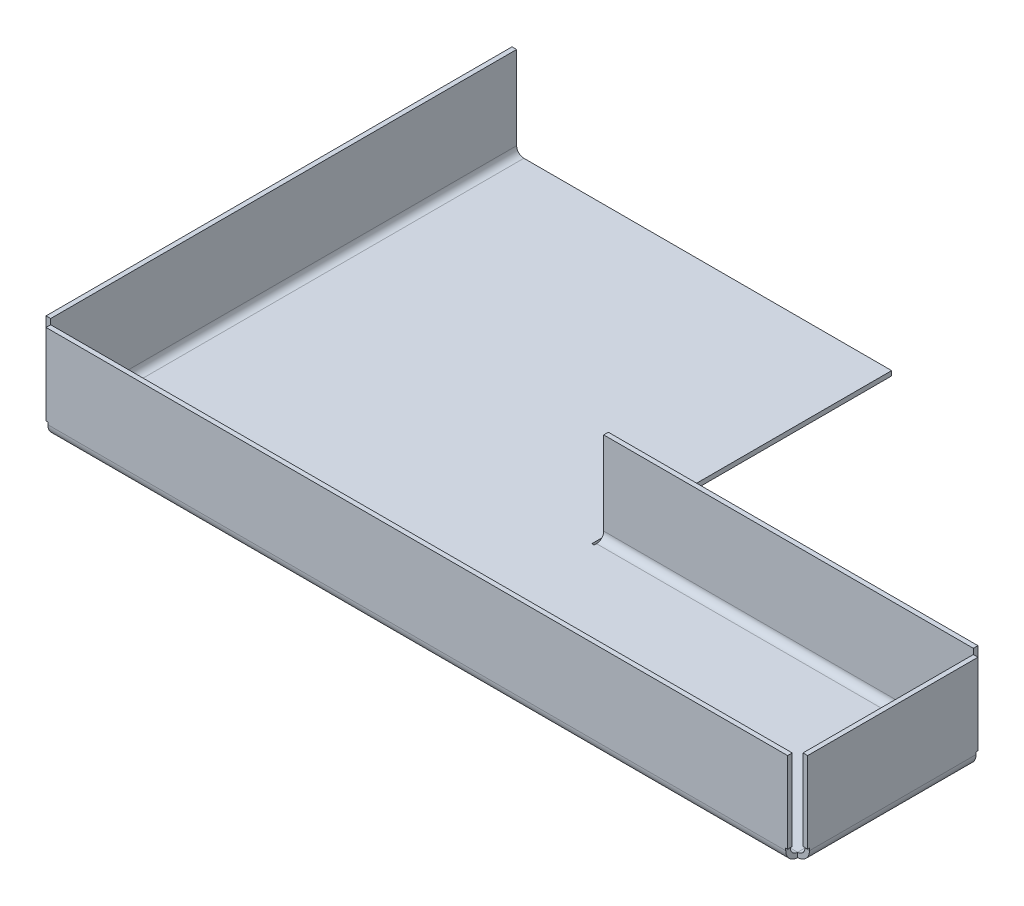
ISO-10303-21;
HEADER;
FILE_DESCRIPTION(('STEP AP214'),'2;1');
FILE_NAME('part.step','',(''),(''),'','','');
FILE_SCHEMA(('AUTOMOTIVE_DESIGN { 1 0 10303 214 1 1 1 1 }'));
ENDSEC;
DATA;
#1=APPLICATION_CONTEXT('core data for automotive mechanical design processes');
#2=APPLICATION_PROTOCOL_DEFINITION('international standard','automotive_design',2000,#1);
#3=PRODUCT_CONTEXT('',#1,'mechanical');
#4=PRODUCT('Part','Part','',(#3));
#5=PRODUCT_RELATED_PRODUCT_CATEGORY('part','',(#4));
#6=PRODUCT_DEFINITION_FORMATION('','',#4);
#7=PRODUCT_DEFINITION_CONTEXT('part definition',#1,'design');
#8=PRODUCT_DEFINITION('design','',#6,#7);
#9=PRODUCT_DEFINITION_SHAPE('','',#8);
#10=(LENGTH_UNIT() NAMED_UNIT(*) SI_UNIT(.MILLI.,.METRE.));
#11=(NAMED_UNIT(*) PLANE_ANGLE_UNIT() SI_UNIT($,.RADIAN.));
#12=(NAMED_UNIT(*) SI_UNIT($,.STERADIAN.) SOLID_ANGLE_UNIT());
#13=UNCERTAINTY_MEASURE_WITH_UNIT(LENGTH_MEASURE(1.E-05),#10,'distance_accuracy_value','');
#14=(GEOMETRIC_REPRESENTATION_CONTEXT(3) GLOBAL_UNCERTAINTY_ASSIGNED_CONTEXT((#13)) GLOBAL_UNIT_ASSIGNED_CONTEXT((#10,
#11,#12)) REPRESENTATION_CONTEXT('',''));
#15=CARTESIAN_POINT('',(0.,0.,0.));
#16=DIRECTION('',(0.,0.,1.));
#17=DIRECTION('',(1.,0.,0.));
#18=AXIS2_PLACEMENT_3D('',#15,#16,#17);
#19=CARTESIAN_POINT('',(0.,0.,-125.));
#20=DIRECTION('',(0.,0.,-1.));
#21=DIRECTION('',(1.,0.,0.));
#22=AXIS2_PLACEMENT_3D('',#19,#20,#21);
#23=PLANE('',#22);
#24=DIRECTION('',(1.,0.,0.));
#25=VECTOR('',#24,1.);
#26=CARTESIAN_POINT('',(0.,1.21412,-125.));
#27=LINE('',#26,#25);
#28=CARTESIAN_POINT('',(3.11912000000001,1.21412,-125.));
#29=VERTEX_POINT('',#28);
#30=CARTESIAN_POINT('',(99.69647,1.21412,-125.));
#31=VERTEX_POINT('',#30);
#32=EDGE_CURVE('E237',#29,#31,#27,.T.);
#33=ORIENTED_EDGE('',*,*,#32,.T.);
#34=DIRECTION('',(0.,1.,0.));
#35=VECTOR('',#34,1.);
#36=CARTESIAN_POINT('',(99.69647,0.,-125.));
#37=LINE('',#36,#35);
#38=CARTESIAN_POINT('',(99.69647,0.,-125.));
#39=VERTEX_POINT('',#38);
#40=EDGE_CURVE('E733',#31,#39,#37,.F.);
#41=ORIENTED_EDGE('',*,*,#40,.T.);
#42=DIRECTION('',(1.,0.,0.));
#43=VECTOR('',#42,1.);
#44=CARTESIAN_POINT('',(0.,0.,-125.));
#45=LINE('',#44,#43);
#46=CARTESIAN_POINT('',(3.11912000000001,0.,-125.));
#47=VERTEX_POINT('',#46);
#48=EDGE_CURVE('E423',#47,#39,#45,.T.);
#49=ORIENTED_EDGE('',*,*,#48,.F.);
#50=DIRECTION('',(0.,-1.,0.));
#51=VECTOR('',#50,1.);
#52=CARTESIAN_POINT('',(3.11912000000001,0.,-125.));
#53=LINE('',#52,#51);
#54=EDGE_CURVE('E11',#29,#47,#53,.T.);
#55=ORIENTED_EDGE('',*,*,#54,.F.);
#56=EDGE_LOOP('',(#33,#41,#49,#55));
#57=FACE_BOUND('',#56,.T.);
#58=ADVANCED_FACE('F38',(#57),#23,.T.);
#59=CARTESIAN_POINT('',(200.,25.,-50.));
#60=DIRECTION('',(0.,1.,0.));
#61=DIRECTION('',(1.,0.,0.));
#62=AXIS2_PLACEMENT_3D('',#59,#60,#61);
#63=PLANE('',#62);
#64=DIRECTION('',(1.,0.,0.));
#65=VECTOR('',#64,1.);
#66=CARTESIAN_POINT('',(200.,25.,-50.));
#67=LINE('',#66,#65);
#68=CARTESIAN_POINT('',(100.30353,25.,-50.));
#69=VERTEX_POINT('',#68);
#70=CARTESIAN_POINT('',(197.371666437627,25.,-50.));
#71=VERTEX_POINT('',#70);
#72=EDGE_CURVE('E732',#69,#71,#67,.T.);
#73=ORIENTED_EDGE('',*,*,#72,.F.);
#74=DIRECTION('',(0.,0.,-1.));
#75=VECTOR('',#74,1.);
#76=CARTESIAN_POINT('',(100.30353,25.,-48.78588));
#77=LINE('',#76,#75);
#78=CARTESIAN_POINT('',(100.30353,25.,-48.78588));
#79=VERTEX_POINT('',#78);
#80=EDGE_CURVE('E289',#69,#79,#77,.F.);
#81=ORIENTED_EDGE('',*,*,#80,.T.);
#82=DIRECTION('',(-1.,0.,0.));
#83=VECTOR('',#82,1.);
#84=CARTESIAN_POINT('',(200.,25.,-48.78588));
#85=LINE('',#84,#83);
#86=CARTESIAN_POINT('',(197.371666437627,25.,-48.78588));
#87=VERTEX_POINT('',#86);
#88=EDGE_CURVE('E218',#79,#87,#85,.F.);
#89=ORIENTED_EDGE('',*,*,#88,.T.);
#90=DIRECTION('',(0.,0.,-1.));
#91=VECTOR('',#90,1.);
#92=CARTESIAN_POINT('',(197.371666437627,25.,-50.));
#93=LINE('',#92,#91);
#94=EDGE_CURVE('E388',#87,#71,#93,.T.);
#95=ORIENTED_EDGE('',*,*,#94,.T.);
#96=EDGE_LOOP('',(#73,#81,#89,#95));
#97=FACE_BOUND('',#96,.T.);
#98=ADVANCED_FACE('F730',(#97),#63,.T.);
#99=CARTESIAN_POINT('',(0.,0.,0.));
#100=DIRECTION('',(0.,-1.,0.));
#101=DIRECTION('',(0.,0.,-1.));
#102=AXIS2_PLACEMENT_3D('',#99,#100,#101);
#103=PLANE('',#102);
#104=ORIENTED_EDGE('',*,*,#48,.T.);
#105=DIRECTION('',(0.,0.,-1.));
#106=VECTOR('',#105,1.);
#107=CARTESIAN_POINT('',(99.69647,0.,0.));
#108=LINE('',#107,#106);
#109=CARTESIAN_POINT('',(99.69647,0.,-46.27382));
#110=VERTEX_POINT('',#109);
#111=EDGE_CURVE('E406',#110,#39,#108,.T.);
#112=ORIENTED_EDGE('',*,*,#111,.F.);
#113=DIRECTION('',(-1.,0.,0.));
#114=VECTOR('',#113,1.);
#115=CARTESIAN_POINT('',(0.,0.,-46.2738200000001));
#116=LINE('',#115,#114);
#117=CARTESIAN_POINT('',(100.30353,0.,-46.27382));
#118=VERTEX_POINT('',#117);
#119=EDGE_CURVE('E419',#118,#110,#116,.T.);
#120=ORIENTED_EDGE('',*,*,#119,.F.);
#121=DIRECTION('',(0.,0.,1.));
#122=VECTOR('',#121,1.);
#123=CARTESIAN_POINT('',(100.30353,0.,0.));
#124=LINE('',#123,#122);
#125=CARTESIAN_POINT('',(100.30353,0.,-46.88088));
#126=VERTEX_POINT('',#125);
#127=EDGE_CURVE('E427',#126,#118,#124,.T.);
#128=ORIENTED_EDGE('',*,*,#127,.F.);
#129=DIRECTION('',(1.,0.,0.));
#130=VECTOR('',#129,1.);
#131=CARTESIAN_POINT('',(0.,0.,-46.88088));
#132=LINE('',#131,#130);
#133=CARTESIAN_POINT('',(196.88088,0.,-46.88088));
#134=VERTEX_POINT('',#133);
#135=EDGE_CURVE('E460',#126,#134,#132,.T.);
#136=ORIENTED_EDGE('',*,*,#135,.T.);
#137=DIRECTION('',(0.,0.,1.));
#138=VECTOR('',#137,1.);
#139=CARTESIAN_POINT('',(196.88088,0.,0.));
#140=LINE('',#139,#138);
#141=CARTESIAN_POINT('',(196.88088,0.,-3.11911999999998));
#142=VERTEX_POINT('',#141);
#143=EDGE_CURVE('E448',#134,#142,#140,.T.);
#144=ORIENTED_EDGE('',*,*,#143,.T.);
#145=DIRECTION('',(-1.,0.,0.));
#146=VECTOR('',#145,1.);
#147=CARTESIAN_POINT('',(0.,0.,-3.11912));
#148=LINE('',#147,#146);
#149=CARTESIAN_POINT('',(3.11911999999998,0.,-3.11911999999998));
#150=VERTEX_POINT('',#149);
#151=EDGE_CURVE('E437',#142,#150,#148,.T.);
#152=ORIENTED_EDGE('',*,*,#151,.T.);
#153=DIRECTION('',(0.,0.,-1.));
#154=VECTOR('',#153,1.);
#155=CARTESIAN_POINT('',(3.11912,0.,0.));
#156=LINE('',#155,#154);
#157=EDGE_CURVE('E429',#150,#47,#156,.T.);
#158=ORIENTED_EDGE('',*,*,#157,.T.);
#159=EDGE_LOOP('',(#104,#112,#120,#128,#136,#144,#152,#158));
#160=FACE_BOUND('',#159,.T.);
#161=ADVANCED_FACE('F417',(#160),#103,.T.);
#162=CARTESIAN_POINT('',(200.,25.,-50.));
#163=DIRECTION('',(0.,0.,-1.));
#164=DIRECTION('',(-1.,0.,0.));
#165=AXIS2_PLACEMENT_3D('',#162,#163,#164);
#166=PLANE('',#165);
#167=DIRECTION('',(0.,-1.,0.));
#168=VECTOR('',#167,1.);
#169=CARTESIAN_POINT('',(100.30353,25.,-50.));
#170=LINE('',#169,#168);
#171=CARTESIAN_POINT('',(100.30353,3.11912,-50.));
#172=VERTEX_POINT('',#171);
#173=EDGE_CURVE('E424',#69,#172,#170,.T.);
#174=ORIENTED_EDGE('',*,*,#173,.F.);
#175=ORIENTED_EDGE('',*,*,#72,.T.);
#176=DIRECTION('',(0.,-1.,0.));
#177=VECTOR('',#176,1.);
#178=CARTESIAN_POINT('',(197.371666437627,25.,-50.));
#179=LINE('',#178,#177);
#180=CARTESIAN_POINT('',(197.371666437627,3.716490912,-50.));
#181=VERTEX_POINT('',#180);
#182=EDGE_CURVE('E742',#71,#181,#179,.T.);
#183=ORIENTED_EDGE('',*,*,#182,.T.);
#184=DIRECTION('',(-1.,0.,0.));
#185=VECTOR('',#184,1.);
#186=CARTESIAN_POINT('',(200.,3.716490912,-50.));
#187=LINE('',#186,#185);
#188=CARTESIAN_POINT('',(196.88088,3.716490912,-50.));
#189=VERTEX_POINT('',#188);
#190=EDGE_CURVE('E560',#181,#189,#187,.T.);
#191=ORIENTED_EDGE('',*,*,#190,.T.);
#192=DIRECTION('',(0.,1.,0.));
#193=VECTOR('',#192,1.);
#194=CARTESIAN_POINT('',(196.88088,25.,-50.));
#195=LINE('',#194,#193);
#196=CARTESIAN_POINT('',(196.88088,3.11912,-50.));
#197=VERTEX_POINT('',#196);
#198=EDGE_CURVE('E561',#197,#189,#195,.T.);
#199=ORIENTED_EDGE('',*,*,#198,.F.);
#200=DIRECTION('',(1.,0.,0.));
#201=VECTOR('',#200,1.);
#202=CARTESIAN_POINT('',(200.,3.11912,-50.));
#203=LINE('',#202,#201);
#204=EDGE_CURVE('E187',#197,#172,#203,.F.);
#205=ORIENTED_EDGE('',*,*,#204,.T.);
#206=EDGE_LOOP('',(#174,#175,#183,#191,#199,#205));
#207=FACE_BOUND('',#206,.T.);
#208=ADVANCED_FACE('F576',(#207),#166,.T.);
#209=CARTESIAN_POINT('',(0.,1.21412,0.));
#210=DIRECTION('',(0.,-1.,0.));
#211=DIRECTION('',(0.,0.,-1.));
#212=AXIS2_PLACEMENT_3D('',#209,#210,#211);
#213=PLANE('',#212);
#214=DIRECTION('',(0.,0.,-1.));
#215=VECTOR('',#214,1.);
#216=CARTESIAN_POINT('',(99.69647,1.21412,0.));
#217=LINE('',#216,#215);
#218=CARTESIAN_POINT('',(99.69647,1.21412,-46.27382));
#219=VERTEX_POINT('',#218);
#220=EDGE_CURVE('E54',#219,#31,#217,.T.);
#221=ORIENTED_EDGE('',*,*,#220,.T.);
#222=ORIENTED_EDGE('',*,*,#32,.F.);
#223=DIRECTION('',(0.,0.,-1.));
#224=VECTOR('',#223,1.);
#225=CARTESIAN_POINT('',(3.11911999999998,1.21412,0.));
#226=LINE('',#225,#224);
#227=CARTESIAN_POINT('',(3.11911999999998,1.21412,-3.11911999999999));
#228=VERTEX_POINT('',#227);
#229=EDGE_CURVE('E204',#228,#29,#226,.T.);
#230=ORIENTED_EDGE('',*,*,#229,.F.);
#231=DIRECTION('',(1.,0.,0.));
#232=VECTOR('',#231,1.);
#233=CARTESIAN_POINT('',(0.,1.21412,-3.11911999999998));
#234=LINE('',#233,#232);
#235=CARTESIAN_POINT('',(196.88088,1.21412,-3.11911999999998));
#236=VERTEX_POINT('',#235);
#237=EDGE_CURVE('E203',#236,#228,#234,.F.);
#238=ORIENTED_EDGE('',*,*,#237,.F.);
#239=DIRECTION('',(0.,0.,-1.));
#240=VECTOR('',#239,1.);
#241=CARTESIAN_POINT('',(196.88088,1.21412,0.));
#242=LINE('',#241,#240);
#243=CARTESIAN_POINT('',(196.88088,1.21412,-46.88088));
#244=VERTEX_POINT('',#243);
#245=EDGE_CURVE('E481',#244,#236,#242,.F.);
#246=ORIENTED_EDGE('',*,*,#245,.F.);
#247=DIRECTION('',(1.,0.,0.));
#248=VECTOR('',#247,1.);
#249=CARTESIAN_POINT('',(0.,1.21412,-46.88088));
#250=LINE('',#249,#248);
#251=CARTESIAN_POINT('',(100.30353,1.21412,-46.88088));
#252=VERTEX_POINT('',#251);
#253=EDGE_CURVE('E477',#252,#244,#250,.T.);
#254=ORIENTED_EDGE('',*,*,#253,.F.);
#255=DIRECTION('',(0.,0.,-1.));
#256=VECTOR('',#255,1.);
#257=CARTESIAN_POINT('',(100.30353,1.21412,0.));
#258=LINE('',#257,#256);
#259=CARTESIAN_POINT('',(100.30353,1.21412,-46.27382));
#260=VERTEX_POINT('',#259);
#261=EDGE_CURVE('E303',#252,#260,#258,.F.);
#262=ORIENTED_EDGE('',*,*,#261,.T.);
#263=DIRECTION('',(1.,0.,0.));
#264=VECTOR('',#263,1.);
#265=CARTESIAN_POINT('',(0.,1.21412,-46.27382));
#266=LINE('',#265,#264);
#267=EDGE_CURVE('E306',#260,#219,#266,.F.);
#268=ORIENTED_EDGE('',*,*,#267,.T.);
#269=EDGE_LOOP('',(#221,#222,#230,#238,#246,#254,#262,#268));
#270=FACE_BOUND('',#269,.T.);
#271=ADVANCED_FACE('F516',(#270),#213,.F.);
#272=CARTESIAN_POINT('',(200.,25.,-48.78588));
#273=DIRECTION('',(0.,0.,-1.));
#274=DIRECTION('',(-1.,0.,0.));
#275=AXIS2_PLACEMENT_3D('',#272,#273,#274);
#276=PLANE('',#275);
#277=ORIENTED_EDGE('',*,*,#88,.F.);
#278=DIRECTION('',(0.,1.,0.));
#279=VECTOR('',#278,1.);
#280=CARTESIAN_POINT('',(100.30353,25.,-48.78588));
#281=LINE('',#280,#279);
#282=CARTESIAN_POINT('',(100.30353,3.11912,-48.78588));
#283=VERTEX_POINT('',#282);
#284=EDGE_CURVE('E293',#79,#283,#281,.F.);
#285=ORIENTED_EDGE('',*,*,#284,.T.);
#286=DIRECTION('',(-1.,0.,0.));
#287=VECTOR('',#286,1.);
#288=CARTESIAN_POINT('',(200.,3.11912000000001,-48.78588));
#289=LINE('',#288,#287);
#290=CARTESIAN_POINT('',(196.88088,3.11912000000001,-48.78588));
#291=VERTEX_POINT('',#290);
#292=EDGE_CURVE('E223',#291,#283,#289,.T.);
#293=ORIENTED_EDGE('',*,*,#292,.F.);
#294=DIRECTION('',(0.,1.,0.));
#295=VECTOR('',#294,1.);
#296=CARTESIAN_POINT('',(196.88088,25.,-48.78588));
#297=LINE('',#296,#295);
#298=CARTESIAN_POINT('',(196.88088,3.71649091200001,-48.78588));
#299=VERTEX_POINT('',#298);
#300=EDGE_CURVE('E290',#291,#299,#297,.T.);
#301=ORIENTED_EDGE('',*,*,#300,.T.);
#302=DIRECTION('',(-1.,0.,0.));
#303=VECTOR('',#302,1.);
#304=CARTESIAN_POINT('',(200.,3.71649091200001,-48.78588));
#305=LINE('',#304,#303);
#306=CARTESIAN_POINT('',(197.371666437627,3.71649091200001,-48.78588));
#307=VERTEX_POINT('',#306);
#308=EDGE_CURVE('E283',#307,#299,#305,.T.);
#309=ORIENTED_EDGE('',*,*,#308,.F.);
#310=DIRECTION('',(0.,1.,0.));
#311=VECTOR('',#310,1.);
#312=CARTESIAN_POINT('',(197.371666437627,25.,-48.78588));
#313=LINE('',#312,#311);
#314=EDGE_CURVE('E277',#87,#307,#313,.F.);
#315=ORIENTED_EDGE('',*,*,#314,.F.);
#316=EDGE_LOOP('',(#277,#285,#293,#301,#309,#315));
#317=FACE_BOUND('',#316,.T.);
#318=ADVANCED_FACE('F736',(#317),#276,.F.);
#319=CARTESIAN_POINT('',(99.69647,0.,0.));
#320=DIRECTION('',(-1.,0.,0.));
#321=DIRECTION('',(0.,0.,-1.));
#322=AXIS2_PLACEMENT_3D('',#319,#320,#321);
#323=PLANE('',#322);
#324=ORIENTED_EDGE('',*,*,#111,.T.);
#325=ORIENTED_EDGE('',*,*,#40,.F.);
#326=ORIENTED_EDGE('',*,*,#220,.F.);
#327=DIRECTION('',(0.,-1.,0.));
#328=VECTOR('',#327,1.);
#329=CARTESIAN_POINT('',(99.69647,0.,-46.27382));
#330=LINE('',#329,#328);
#331=EDGE_CURVE('E47',#219,#110,#330,.T.);
#332=ORIENTED_EDGE('',*,*,#331,.T.);
#333=EDGE_LOOP('',(#324,#325,#326,#332));
#334=FACE_BOUND('',#333,.T.);
#335=ADVANCED_FACE('F404',(#334),#323,.F.);
#336=CARTESIAN_POINT('',(0.,0.,-46.2738200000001));
#337=DIRECTION('',(0.,0.,1.));
#338=DIRECTION('',(-1.,0.,0.));
#339=AXIS2_PLACEMENT_3D('',#336,#337,#338);
#340=PLANE('',#339);
#341=ORIENTED_EDGE('',*,*,#331,.F.);
#342=ORIENTED_EDGE('',*,*,#267,.F.);
#343=DIRECTION('',(0.,-1.,0.));
#344=VECTOR('',#343,1.);
#345=CARTESIAN_POINT('',(100.30353,0.,-46.27382));
#346=LINE('',#345,#344);
#347=EDGE_CURVE('E396',#260,#118,#346,.T.);
#348=ORIENTED_EDGE('',*,*,#347,.T.);
#349=ORIENTED_EDGE('',*,*,#119,.T.);
#350=EDGE_LOOP('',(#341,#342,#348,#349));
#351=FACE_BOUND('',#350,.T.);
#352=ADVANCED_FACE('F426',(#351),#340,.F.);
#353=CARTESIAN_POINT('',(100.30353,0.,0.));
#354=DIRECTION('',(1.,0.,0.));
#355=DIRECTION('',(0.,0.,1.));
#356=AXIS2_PLACEMENT_3D('',#353,#354,#355);
#357=PLANE('',#356);
#358=ORIENTED_EDGE('',*,*,#347,.F.);
#359=ORIENTED_EDGE('',*,*,#261,.F.);
#360=DIRECTION('',(0.,-1.,0.));
#361=VECTOR('',#360,1.);
#362=CARTESIAN_POINT('',(100.30353,0.,-46.88088));
#363=LINE('',#362,#361);
#364=EDGE_CURVE('E393',#252,#126,#363,.T.);
#365=ORIENTED_EDGE('',*,*,#364,.T.);
#366=ORIENTED_EDGE('',*,*,#127,.T.);
#367=EDGE_LOOP('',(#358,#359,#365,#366));
#368=FACE_BOUND('',#367,.T.);
#369=ADVANCED_FACE('F585',(#368),#357,.F.);
#370=CARTESIAN_POINT('',(100.30353,3.11912,-46.88088));
#371=DIRECTION('',(1.,0.,0.));
#372=DIRECTION('',(0.,0.,-1.));
#373=AXIS2_PLACEMENT_3D('',#370,#371,#372);
#374=PLANE('',#373);
#375=ORIENTED_EDGE('',*,*,#364,.F.);
#376=CARTESIAN_POINT('',(100.30353,3.11912,-46.88088));
#377=DIRECTION('',(1.,0.,0.));
#378=DIRECTION('',(0.,0.,-1.));
#379=AXIS2_PLACEMENT_3D('',#376,#377,#378);
#380=CIRCLE('',#379,1.905);
#381=EDGE_CURVE('E267',#252,#283,#380,.T.);
#382=ORIENTED_EDGE('',*,*,#381,.T.);
#383=DIRECTION('',(0.,0.,-1.));
#384=VECTOR('',#383,1.);
#385=CARTESIAN_POINT('',(100.30353,3.11912,-50.));
#386=LINE('',#385,#384);
#387=EDGE_CURVE('E391',#283,#172,#386,.T.);
#388=ORIENTED_EDGE('',*,*,#387,.T.);
#389=CARTESIAN_POINT('',(100.30353,3.11912,-46.88088));
#390=DIRECTION('',(-1.,0.,0.));
#391=DIRECTION('',(0.,0.,1.));
#392=AXIS2_PLACEMENT_3D('',#389,#390,#391);
#393=CIRCLE('',#392,3.11912);
#394=EDGE_CURVE('E464',#126,#172,#393,.F.);
#395=ORIENTED_EDGE('',*,*,#394,.F.);
#396=EDGE_LOOP('',(#375,#382,#388,#395));
#397=FACE_BOUND('',#396,.T.);
#398=ADVANCED_FACE('F582',(#397),#374,.F.);
#399=CARTESIAN_POINT('',(100.30353,25.,-50.));
#400=DIRECTION('',(1.,0.,0.));
#401=DIRECTION('',(0.,-1.,0.));
#402=AXIS2_PLACEMENT_3D('',#399,#400,#401);
#403=PLANE('',#402);
#404=ORIENTED_EDGE('',*,*,#387,.F.);
#405=ORIENTED_EDGE('',*,*,#284,.F.);
#406=ORIENTED_EDGE('',*,*,#80,.F.);
#407=ORIENTED_EDGE('',*,*,#173,.T.);
#408=EDGE_LOOP('',(#404,#405,#406,#407));
#409=FACE_BOUND('',#408,.T.);
#410=ADVANCED_FACE('F568',(#409),#403,.F.);
#411=CARTESIAN_POINT('',(197.371666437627,25.,-50.));
#412=DIRECTION('',(1.,0.,0.));
#413=DIRECTION('',(0.,-1.,0.));
#414=AXIS2_PLACEMENT_3D('',#411,#412,#413);
#415=PLANE('',#414);
#416=ORIENTED_EDGE('',*,*,#94,.F.);
#417=ORIENTED_EDGE('',*,*,#314,.T.);
#418=DIRECTION('',(0.,0.,-1.));
#419=VECTOR('',#418,1.);
#420=CARTESIAN_POINT('',(197.371666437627,3.716490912,-50.));
#421=LINE('',#420,#419);
#422=EDGE_CURVE('E385',#307,#181,#421,.T.);
#423=ORIENTED_EDGE('',*,*,#422,.T.);
#424=ORIENTED_EDGE('',*,*,#182,.F.);
#425=EDGE_LOOP('',(#416,#417,#423,#424));
#426=FACE_BOUND('',#425,.T.);
#427=ADVANCED_FACE('F739',(#426),#415,.T.);
#428=CARTESIAN_POINT('',(200.,3.716490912,-50.));
#429=DIRECTION('',(0.,-1.,0.));
#430=DIRECTION('',(-1.,0.,0.));
#431=AXIS2_PLACEMENT_3D('',#428,#429,#430);
#432=PLANE('',#431);
#433=ORIENTED_EDGE('',*,*,#422,.F.);
#434=ORIENTED_EDGE('',*,*,#308,.T.);
#435=DIRECTION('',(0.,0.,-1.));
#436=VECTOR('',#435,1.);
#437=CARTESIAN_POINT('',(196.88088,3.716490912,-50.));
#438=LINE('',#437,#436);
#439=EDGE_CURVE('E382',#299,#189,#438,.T.);
#440=ORIENTED_EDGE('',*,*,#439,.T.);
#441=ORIENTED_EDGE('',*,*,#190,.F.);
#442=EDGE_LOOP('',(#433,#434,#440,#441));
#443=FACE_BOUND('',#442,.T.);
#444=ADVANCED_FACE('F775',(#443),#432,.T.);
#445=CARTESIAN_POINT('',(196.88088,25.,-50.));
#446=DIRECTION('',(-1.,0.,0.));
#447=DIRECTION('',(0.,1.,0.));
#448=AXIS2_PLACEMENT_3D('',#445,#446,#447);
#449=PLANE('',#448);
#450=ORIENTED_EDGE('',*,*,#439,.F.);
#451=ORIENTED_EDGE('',*,*,#300,.F.);
#452=DIRECTION('',(0.,0.,-1.));
#453=VECTOR('',#452,1.);
#454=CARTESIAN_POINT('',(196.88088,3.11912,-50.));
#455=LINE('',#454,#453);
#456=EDGE_CURVE('E63',#291,#197,#455,.T.);
#457=ORIENTED_EDGE('',*,*,#456,.T.);
#458=ORIENTED_EDGE('',*,*,#198,.T.);
#459=EDGE_LOOP('',(#450,#451,#457,#458));
#460=FACE_BOUND('',#459,.T.);
#461=ADVANCED_FACE('F778',(#460),#449,.F.);
#462=CARTESIAN_POINT('',(196.88088,3.11912,-46.88088));
#463=DIRECTION('',(-1.,0.,0.));
#464=DIRECTION('',(0.,0.,1.));
#465=AXIS2_PLACEMENT_3D('',#462,#463,#464);
#466=PLANE('',#465);
#467=ORIENTED_EDGE('',*,*,#456,.F.);
#468=CARTESIAN_POINT('',(196.88088,3.11912,-46.88088));
#469=DIRECTION('',(1.,0.,0.));
#470=DIRECTION('',(0.,0.,-1.));
#471=AXIS2_PLACEMENT_3D('',#468,#469,#470);
#472=CIRCLE('',#471,1.905);
#473=EDGE_CURVE('E286',#291,#244,#472,.F.);
#474=ORIENTED_EDGE('',*,*,#473,.T.);
#475=DIRECTION('',(0.,-1.,0.));
#476=VECTOR('',#475,1.);
#477=CARTESIAN_POINT('',(196.88088,0.,-46.88088));
#478=LINE('',#477,#476);
#479=EDGE_CURVE('E378',#244,#134,#478,.T.);
#480=ORIENTED_EDGE('',*,*,#479,.T.);
#481=CARTESIAN_POINT('',(196.88088,3.11912,-46.88088));
#482=DIRECTION('',(1.,0.,0.));
#483=DIRECTION('',(0.,0.,-1.));
#484=AXIS2_PLACEMENT_3D('',#481,#482,#483);
#485=CIRCLE('',#484,3.11912);
#486=EDGE_CURVE('E471',#197,#134,#485,.F.);
#487=ORIENTED_EDGE('',*,*,#486,.F.);
#488=EDGE_LOOP('',(#467,#474,#480,#487));
#489=FACE_BOUND('',#488,.T.);
#490=ADVANCED_FACE('F782',(#489),#466,.F.);
#491=CARTESIAN_POINT('',(196.88088,3.11912,-46.88088));
#492=DIRECTION('',(0.,0.,1.));
#493=DIRECTION('',(1.,0.,0.));
#494=AXIS2_PLACEMENT_3D('',#491,#492,#493);
#495=PLANE('',#494);
#496=ORIENTED_EDGE('',*,*,#479,.F.);
#497=CARTESIAN_POINT('',(196.88088,3.11912,-46.88088));
#498=DIRECTION('',(0.,0.,1.));
#499=DIRECTION('',(1.,0.,0.));
#500=AXIS2_PLACEMENT_3D('',#497,#498,#499);
#501=CIRCLE('',#500,1.905);
#502=CARTESIAN_POINT('',(198.78588,3.11912,-46.88088));
#503=VERTEX_POINT('',#502);
#504=EDGE_CURVE('E241',#244,#503,#501,.T.);
#505=ORIENTED_EDGE('',*,*,#504,.T.);
#506=DIRECTION('',(1.,0.,0.));
#507=VECTOR('',#506,1.);
#508=CARTESIAN_POINT('',(200.,3.11912,-46.88088));
#509=LINE('',#508,#507);
#510=CARTESIAN_POINT('',(200.,3.11912,-46.88088));
#511=VERTEX_POINT('',#510);
#512=EDGE_CURVE('E375',#503,#511,#509,.T.);
#513=ORIENTED_EDGE('',*,*,#512,.T.);
#514=CARTESIAN_POINT('',(196.88088,3.11912,-46.88088));
#515=DIRECTION('',(0.,0.,-1.));
#516=DIRECTION('',(-1.,0.,0.));
#517=AXIS2_PLACEMENT_3D('',#514,#515,#516);
#518=CIRCLE('',#517,3.11912);
#519=EDGE_CURVE('E452',#134,#511,#518,.F.);
#520=ORIENTED_EDGE('',*,*,#519,.F.);
#521=EDGE_LOOP('',(#496,#505,#513,#520));
#522=FACE_BOUND('',#521,.T.);
#523=ADVANCED_FACE('F502',(#522),#495,.F.);
#524=CARTESIAN_POINT('',(200.,25.,-46.88088));
#525=DIRECTION('',(0.,0.,1.));
#526=DIRECTION('',(0.,-1.,0.));
#527=AXIS2_PLACEMENT_3D('',#524,#525,#526);
#528=PLANE('',#527);
#529=ORIENTED_EDGE('',*,*,#512,.F.);
#530=DIRECTION('',(0.,1.,0.));
#531=VECTOR('',#530,1.);
#532=CARTESIAN_POINT('',(198.78588,25.,-46.88088));
#533=LINE('',#532,#531);
#534=CARTESIAN_POINT('',(198.78588,3.716490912,-46.88088));
#535=VERTEX_POINT('',#534);
#536=EDGE_CURVE('E280',#535,#503,#533,.F.);
#537=ORIENTED_EDGE('',*,*,#536,.F.);
#538=DIRECTION('',(1.,0.,0.));
#539=VECTOR('',#538,1.);
#540=CARTESIAN_POINT('',(200.,3.716490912,-46.88088));
#541=LINE('',#540,#539);
#542=CARTESIAN_POINT('',(200.,3.716490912,-46.88088));
#543=VERTEX_POINT('',#542);
#544=EDGE_CURVE('E372',#535,#543,#541,.T.);
#545=ORIENTED_EDGE('',*,*,#544,.T.);
#546=DIRECTION('',(0.,-1.,0.));
#547=VECTOR('',#546,1.);
#548=CARTESIAN_POINT('',(200.,25.,-46.88088));
#549=LINE('',#548,#547);
#550=EDGE_CURVE('E557',#543,#511,#549,.T.);
#551=ORIENTED_EDGE('',*,*,#550,.T.);
#552=EDGE_LOOP('',(#529,#537,#545,#551));
#553=FACE_BOUND('',#552,.T.);
#554=ADVANCED_FACE('F787',(#553),#528,.F.);
#555=CARTESIAN_POINT('',(200.,3.716490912,-50.));
#556=DIRECTION('',(0.,-1.,0.));
#557=DIRECTION('',(0.,0.,-1.));
#558=AXIS2_PLACEMENT_3D('',#555,#556,#557);
#559=PLANE('',#558);
#560=ORIENTED_EDGE('',*,*,#544,.F.);
#561=DIRECTION('',(0.,0.,-1.));
#562=VECTOR('',#561,1.);
#563=CARTESIAN_POINT('',(198.78588,3.716490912,-50.));
#564=LINE('',#563,#562);
#565=CARTESIAN_POINT('',(198.78588,3.716490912,-47.3716664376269));
#566=VERTEX_POINT('',#565);
#567=EDGE_CURVE('E261',#535,#566,#564,.T.);
#568=ORIENTED_EDGE('',*,*,#567,.T.);
#569=DIRECTION('',(1.,0.,0.));
#570=VECTOR('',#569,1.);
#571=CARTESIAN_POINT('',(200.,3.716490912,-47.3716664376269));
#572=LINE('',#571,#570);
#573=CARTESIAN_POINT('',(200.,3.716490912,-47.3716664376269));
#574=VERTEX_POINT('',#573);
#575=EDGE_CURVE('E369',#566,#574,#572,.T.);
#576=ORIENTED_EDGE('',*,*,#575,.T.);
#577=DIRECTION('',(0.,0.,-1.));
#578=VECTOR('',#577,1.);
#579=CARTESIAN_POINT('',(200.,3.716490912,-50.));
#580=LINE('',#579,#578);
#581=EDGE_CURVE('E554',#543,#574,#580,.T.);
#582=ORIENTED_EDGE('',*,*,#581,.F.);
#583=EDGE_LOOP('',(#560,#568,#576,#582));
#584=FACE_BOUND('',#583,.T.);
#585=ADVANCED_FACE('F790',(#584),#559,.T.);
#586=CARTESIAN_POINT('',(200.,25.,-47.3716664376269));
#587=DIRECTION('',(0.,0.,-1.));
#588=DIRECTION('',(0.,1.,0.));
#589=AXIS2_PLACEMENT_3D('',#586,#587,#588);
#590=PLANE('',#589);
#591=ORIENTED_EDGE('',*,*,#575,.F.);
#592=DIRECTION('',(0.,1.,0.));
#593=VECTOR('',#592,1.);
#594=CARTESIAN_POINT('',(198.78588,25.,-47.3716664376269));
#595=LINE('',#594,#593);
#596=CARTESIAN_POINT('',(198.78588,25.,-47.3716664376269));
#597=VERTEX_POINT('',#596);
#598=EDGE_CURVE('E273',#566,#597,#595,.T.);
#599=ORIENTED_EDGE('',*,*,#598,.T.);
#600=DIRECTION('',(1.,0.,0.));
#601=VECTOR('',#600,1.);
#602=CARTESIAN_POINT('',(200.,25.,-47.3716664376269));
#603=LINE('',#602,#601);
#604=CARTESIAN_POINT('',(200.,25.,-47.3716664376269));
#605=VERTEX_POINT('',#604);
#606=EDGE_CURVE('E366',#597,#605,#603,.T.);
#607=ORIENTED_EDGE('',*,*,#606,.T.);
#608=DIRECTION('',(0.,1.,0.));
#609=VECTOR('',#608,1.);
#610=CARTESIAN_POINT('',(200.,25.,-47.3716664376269));
#611=LINE('',#610,#609);
#612=EDGE_CURVE('E661',#574,#605,#611,.T.);
#613=ORIENTED_EDGE('',*,*,#612,.F.);
#614=EDGE_LOOP('',(#591,#599,#607,#613));
#615=FACE_BOUND('',#614,.T.);
#616=ADVANCED_FACE('F793',(#615),#590,.T.);
#617=CARTESIAN_POINT('',(200.,25.,-50.));
#618=DIRECTION('',(0.,1.,0.));
#619=DIRECTION('',(0.,0.,1.));
#620=AXIS2_PLACEMENT_3D('',#617,#618,#619);
#621=PLANE('',#620);
#622=ORIENTED_EDGE('',*,*,#606,.F.);
#623=DIRECTION('',(0.,0.,-1.));
#624=VECTOR('',#623,1.);
#625=CARTESIAN_POINT('',(198.78588,25.,-50.));
#626=LINE('',#625,#624);
#627=CARTESIAN_POINT('',(198.78588,25.,-2.6283335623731));
#628=VERTEX_POINT('',#627);
#629=EDGE_CURVE('E214',#597,#628,#626,.F.);
#630=ORIENTED_EDGE('',*,*,#629,.T.);
#631=DIRECTION('',(1.,0.,0.));
#632=VECTOR('',#631,1.);
#633=CARTESIAN_POINT('',(200.,25.,-2.6283335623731));
#634=LINE('',#633,#632);
#635=CARTESIAN_POINT('',(200.,25.,-2.6283335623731));
#636=VERTEX_POINT('',#635);
#637=EDGE_CURVE('E363',#628,#636,#634,.T.);
#638=ORIENTED_EDGE('',*,*,#637,.T.);
#639=DIRECTION('',(0.,0.,1.));
#640=VECTOR('',#639,1.);
#641=CARTESIAN_POINT('',(200.,25.,-50.));
#642=LINE('',#641,#640);
#643=EDGE_CURVE('E746',#605,#636,#642,.T.);
#644=ORIENTED_EDGE('',*,*,#643,.F.);
#645=EDGE_LOOP('',(#622,#630,#638,#644));
#646=FACE_BOUND('',#645,.T.);
#647=ADVANCED_FACE('F797',(#646),#621,.T.);
#648=CARTESIAN_POINT('',(200.,25.,-2.6283335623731));
#649=DIRECTION('',(0.,0.,1.));
#650=DIRECTION('',(0.,-1.,0.));
#651=AXIS2_PLACEMENT_3D('',#648,#649,#650);
#652=PLANE('',#651);
#653=ORIENTED_EDGE('',*,*,#637,.F.);
#654=DIRECTION('',(0.,1.,0.));
#655=VECTOR('',#654,1.);
#656=CARTESIAN_POINT('',(198.78588,25.,-2.6283335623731));
#657=LINE('',#656,#655);
#658=CARTESIAN_POINT('',(198.78588,3.716490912,-2.6283335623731));
#659=VERTEX_POINT('',#658);
#660=EDGE_CURVE('E253',#628,#659,#657,.F.);
#661=ORIENTED_EDGE('',*,*,#660,.T.);
#662=DIRECTION('',(1.,0.,0.));
#663=VECTOR('',#662,1.);
#664=CARTESIAN_POINT('',(200.,3.716490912,-2.6283335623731));
#665=LINE('',#664,#663);
#666=CARTESIAN_POINT('',(200.,3.716490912,-2.6283335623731));
#667=VERTEX_POINT('',#666);
#668=EDGE_CURVE('E360',#659,#667,#665,.T.);
#669=ORIENTED_EDGE('',*,*,#668,.T.);
#670=DIRECTION('',(0.,-1.,0.));
#671=VECTOR('',#670,1.);
#672=CARTESIAN_POINT('',(200.,25.,-2.6283335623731));
#673=LINE('',#672,#671);
#674=EDGE_CURVE('E657',#636,#667,#673,.T.);
#675=ORIENTED_EDGE('',*,*,#674,.F.);
#676=EDGE_LOOP('',(#653,#661,#669,#675));
#677=FACE_BOUND('',#676,.T.);
#678=ADVANCED_FACE('F801',(#677),#652,.T.);
#679=CARTESIAN_POINT('',(200.,3.716490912,-50.));
#680=DIRECTION('',(0.,-1.,0.));
#681=DIRECTION('',(0.,0.,-1.));
#682=AXIS2_PLACEMENT_3D('',#679,#680,#681);
#683=PLANE('',#682);
#684=ORIENTED_EDGE('',*,*,#668,.F.);
#685=DIRECTION('',(0.,0.,-1.));
#686=VECTOR('',#685,1.);
#687=CARTESIAN_POINT('',(198.78588,3.716490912,-50.));
#688=LINE('',#687,#686);
#689=CARTESIAN_POINT('',(198.78588,3.716490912,-3.11911999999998));
#690=VERTEX_POINT('',#689);
#691=EDGE_CURVE('E235',#659,#690,#688,.T.);
#692=ORIENTED_EDGE('',*,*,#691,.T.);
#693=DIRECTION('',(1.,0.,0.));
#694=VECTOR('',#693,1.);
#695=CARTESIAN_POINT('',(200.,3.716490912,-3.11911999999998));
#696=LINE('',#695,#694);
#697=CARTESIAN_POINT('',(200.,3.716490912,-3.11911999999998));
#698=VERTEX_POINT('',#697);
#699=EDGE_CURVE('E357',#690,#698,#696,.T.);
#700=ORIENTED_EDGE('',*,*,#699,.T.);
#701=DIRECTION('',(0.,0.,-1.));
#702=VECTOR('',#701,1.);
#703=CARTESIAN_POINT('',(200.,3.716490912,-50.));
#704=LINE('',#703,#702);
#705=EDGE_CURVE('E542',#667,#698,#704,.T.);
#706=ORIENTED_EDGE('',*,*,#705,.F.);
#707=EDGE_LOOP('',(#684,#692,#700,#706));
#708=FACE_BOUND('',#707,.T.);
#709=ADVANCED_FACE('F805',(#708),#683,.T.);
#710=CARTESIAN_POINT('',(200.,25.,-3.11911999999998));
#711=DIRECTION('',(0.,0.,-1.));
#712=DIRECTION('',(0.,1.,0.));
#713=AXIS2_PLACEMENT_3D('',#710,#711,#712);
#714=PLANE('',#713);
#715=ORIENTED_EDGE('',*,*,#699,.F.);
#716=DIRECTION('',(0.,1.,0.));
#717=VECTOR('',#716,1.);
#718=CARTESIAN_POINT('',(198.78588,25.,-3.11911999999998));
#719=LINE('',#718,#717);
#720=CARTESIAN_POINT('',(198.78588,3.11912,-3.11911999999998));
#721=VERTEX_POINT('',#720);
#722=EDGE_CURVE('E258',#721,#690,#719,.T.);
#723=ORIENTED_EDGE('',*,*,#722,.F.);
#724=DIRECTION('',(1.,0.,0.));
#725=VECTOR('',#724,1.);
#726=CARTESIAN_POINT('',(200.,3.11912,-3.11911999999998));
#727=LINE('',#726,#725);
#728=CARTESIAN_POINT('',(200.,3.11912,-3.11911999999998));
#729=VERTEX_POINT('',#728);
#730=EDGE_CURVE('E354',#721,#729,#727,.T.);
#731=ORIENTED_EDGE('',*,*,#730,.T.);
#732=DIRECTION('',(0.,1.,0.));
#733=VECTOR('',#732,1.);
#734=CARTESIAN_POINT('',(200.,25.,-3.11911999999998));
#735=LINE('',#734,#733);
#736=EDGE_CURVE('E534',#729,#698,#735,.T.);
#737=ORIENTED_EDGE('',*,*,#736,.T.);
#738=EDGE_LOOP('',(#715,#723,#731,#737));
#739=FACE_BOUND('',#738,.T.);
#740=ADVANCED_FACE('F532',(#739),#714,.F.);
#741=CARTESIAN_POINT('',(196.88088,3.11912,-3.11911999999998));
#742=DIRECTION('',(0.,0.,-1.));
#743=DIRECTION('',(-1.,0.,0.));
#744=AXIS2_PLACEMENT_3D('',#741,#742,#743);
#745=PLANE('',#744);
#746=ORIENTED_EDGE('',*,*,#730,.F.);
#747=CARTESIAN_POINT('',(196.88088,3.11912,-3.11911999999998));
#748=DIRECTION('',(0.,0.,1.));
#749=DIRECTION('',(1.,0.,0.));
#750=AXIS2_PLACEMENT_3D('',#747,#748,#749);
#751=CIRCLE('',#750,1.905);
#752=EDGE_CURVE('E264',#721,#236,#751,.F.);
#753=ORIENTED_EDGE('',*,*,#752,.T.);
#754=DIRECTION('',(0.,-1.,0.));
#755=VECTOR('',#754,1.);
#756=CARTESIAN_POINT('',(196.88088,0.,-3.11911999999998));
#757=LINE('',#756,#755);
#758=EDGE_CURVE('E351',#236,#142,#757,.T.);
#759=ORIENTED_EDGE('',*,*,#758,.T.);
#760=CARTESIAN_POINT('',(196.88088,3.11912,-3.11911999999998));
#761=DIRECTION('',(0.,0.,1.));
#762=DIRECTION('',(1.,0.,0.));
#763=AXIS2_PLACEMENT_3D('',#760,#761,#762);
#764=CIRCLE('',#763,3.11912);
#765=EDGE_CURVE('E461',#729,#142,#764,.F.);
#766=ORIENTED_EDGE('',*,*,#765,.F.);
#767=EDGE_LOOP('',(#746,#753,#759,#766));
#768=FACE_BOUND('',#767,.T.);
#769=ADVANCED_FACE('F524',(#768),#745,.F.);
#770=CARTESIAN_POINT('',(196.88088,3.11912,-3.11912));
#771=DIRECTION('',(-1.,0.,0.));
#772=DIRECTION('',(0.,0.,1.));
#773=AXIS2_PLACEMENT_3D('',#770,#771,#772);
#774=PLANE('',#773);
#775=ORIENTED_EDGE('',*,*,#758,.F.);
#776=CARTESIAN_POINT('',(196.88088,3.11912,-3.11912));
#777=DIRECTION('',(-1.,0.,0.));
#778=DIRECTION('',(0.,0.,1.));
#779=AXIS2_PLACEMENT_3D('',#776,#777,#778);
#780=CIRCLE('',#779,1.905);
#781=CARTESIAN_POINT('',(196.88088,3.11912,-1.21412));
#782=VERTEX_POINT('',#781);
#783=EDGE_CURVE('E210',#236,#782,#780,.T.);
#784=ORIENTED_EDGE('',*,*,#783,.T.);
#785=DIRECTION('',(0.,0.,1.));
#786=VECTOR('',#785,1.);
#787=CARTESIAN_POINT('',(196.88088,3.11912,0.));
#788=LINE('',#787,#786);
#789=CARTESIAN_POINT('',(196.88088,3.11912,0.));
#790=VERTEX_POINT('',#789);
#791=EDGE_CURVE('E348',#782,#790,#788,.T.);
#792=ORIENTED_EDGE('',*,*,#791,.T.);
#793=CARTESIAN_POINT('',(196.88088,3.11912,-3.11912));
#794=DIRECTION('',(1.,0.,0.));
#795=DIRECTION('',(0.,0.,-1.));
#796=AXIS2_PLACEMENT_3D('',#793,#794,#795);
#797=CIRCLE('',#796,3.11912);
#798=EDGE_CURVE('E440',#142,#790,#797,.F.);
#799=ORIENTED_EDGE('',*,*,#798,.F.);
#800=EDGE_LOOP('',(#775,#784,#792,#799));
#801=FACE_BOUND('',#800,.T.);
#802=ADVANCED_FACE('F814',(#801),#774,.F.);
#803=CARTESIAN_POINT('',(196.88088,25.,0.));
#804=DIRECTION('',(-1.,0.,0.));
#805=DIRECTION('',(0.,-1.,0.));
#806=AXIS2_PLACEMENT_3D('',#803,#804,#805);
#807=PLANE('',#806);
#808=ORIENTED_EDGE('',*,*,#791,.F.);
#809=DIRECTION('',(0.,1.,0.));
#810=VECTOR('',#809,1.);
#811=CARTESIAN_POINT('',(196.88088,25.,-1.21412));
#812=LINE('',#811,#810);
#813=CARTESIAN_POINT('',(196.88088,3.716490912,-1.21412));
#814=VERTEX_POINT('',#813);
#815=EDGE_CURVE('E257',#814,#782,#812,.F.);
#816=ORIENTED_EDGE('',*,*,#815,.F.);
#817=DIRECTION('',(0.,0.,1.));
#818=VECTOR('',#817,1.);
#819=CARTESIAN_POINT('',(196.88088,3.716490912,0.));
#820=LINE('',#819,#818);
#821=CARTESIAN_POINT('',(196.88088,3.716490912,0.));
#822=VERTEX_POINT('',#821);
#823=EDGE_CURVE('E345',#814,#822,#820,.T.);
#824=ORIENTED_EDGE('',*,*,#823,.T.);
#825=DIRECTION('',(0.,-1.,0.));
#826=VECTOR('',#825,1.);
#827=CARTESIAN_POINT('',(196.88088,25.,0.));
#828=LINE('',#827,#826);
#829=EDGE_CURVE('E546',#822,#790,#828,.T.);
#830=ORIENTED_EDGE('',*,*,#829,.T.);
#831=EDGE_LOOP('',(#808,#816,#824,#830));
#832=FACE_BOUND('',#831,.T.);
#833=ADVANCED_FACE('F625',(#832),#807,.F.);
#834=CARTESIAN_POINT('',(0.,3.716490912,0.));
#835=DIRECTION('',(0.,-1.,0.));
#836=DIRECTION('',(1.,0.,0.));
#837=AXIS2_PLACEMENT_3D('',#834,#835,#836);
#838=PLANE('',#837);
#839=ORIENTED_EDGE('',*,*,#823,.F.);
#840=DIRECTION('',(1.,0.,0.));
#841=VECTOR('',#840,1.);
#842=CARTESIAN_POINT('',(0.,3.716490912,-1.21412));
#843=LINE('',#842,#841);
#844=CARTESIAN_POINT('',(197.371666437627,3.716490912,-1.21412));
#845=VERTEX_POINT('',#844);
#846=EDGE_CURVE('E254',#814,#845,#843,.T.);
#847=ORIENTED_EDGE('',*,*,#846,.T.);
#848=DIRECTION('',(0.,0.,1.));
#849=VECTOR('',#848,1.);
#850=CARTESIAN_POINT('',(197.371666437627,3.716490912,0.));
#851=LINE('',#850,#849);
#852=CARTESIAN_POINT('',(197.371666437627,3.716490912,0.));
#853=VERTEX_POINT('',#852);
#854=EDGE_CURVE('E342',#845,#853,#851,.T.);
#855=ORIENTED_EDGE('',*,*,#854,.T.);
#856=DIRECTION('',(1.,0.,0.));
#857=VECTOR('',#856,1.);
#858=CARTESIAN_POINT('',(0.,3.716490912,0.));
#859=LINE('',#858,#857);
#860=EDGE_CURVE('E543',#822,#853,#859,.T.);
#861=ORIENTED_EDGE('',*,*,#860,.F.);
#862=EDGE_LOOP('',(#839,#847,#855,#861));
#863=FACE_BOUND('',#862,.T.);
#864=ADVANCED_FACE('F635',(#863),#838,.T.);
#865=CARTESIAN_POINT('',(197.371666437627,25.,0.));
#866=DIRECTION('',(1.,0.,0.));
#867=DIRECTION('',(0.,1.,0.));
#868=AXIS2_PLACEMENT_3D('',#865,#866,#867);
#869=PLANE('',#868);
#870=ORIENTED_EDGE('',*,*,#854,.F.);
#871=DIRECTION('',(0.,1.,0.));
#872=VECTOR('',#871,1.);
#873=CARTESIAN_POINT('',(197.371666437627,25.,-1.21412));
#874=LINE('',#873,#872);
#875=CARTESIAN_POINT('',(197.371666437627,25.,-1.21412));
#876=VERTEX_POINT('',#875);
#877=EDGE_CURVE('E248',#845,#876,#874,.T.);
#878=ORIENTED_EDGE('',*,*,#877,.T.);
#879=DIRECTION('',(0.,0.,1.));
#880=VECTOR('',#879,1.);
#881=CARTESIAN_POINT('',(197.371666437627,25.,0.));
#882=LINE('',#881,#880);
#883=CARTESIAN_POINT('',(197.371666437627,25.,0.));
#884=VERTEX_POINT('',#883);
#885=EDGE_CURVE('E339',#876,#884,#882,.T.);
#886=ORIENTED_EDGE('',*,*,#885,.T.);
#887=DIRECTION('',(0.,1.,0.));
#888=VECTOR('',#887,1.);
#889=CARTESIAN_POINT('',(197.371666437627,25.,0.));
#890=LINE('',#889,#888);
#891=EDGE_CURVE('E641',#853,#884,#890,.T.);
#892=ORIENTED_EDGE('',*,*,#891,.F.);
#893=EDGE_LOOP('',(#870,#878,#886,#892));
#894=FACE_BOUND('',#893,.T.);
#895=ADVANCED_FACE('F640',(#894),#869,.T.);
#896=CARTESIAN_POINT('',(0.,25.,0.));
#897=DIRECTION('',(0.,1.,0.));
#898=DIRECTION('',(-1.,0.,0.));
#899=AXIS2_PLACEMENT_3D('',#896,#897,#898);
#900=PLANE('',#899);
#901=ORIENTED_EDGE('',*,*,#885,.F.);
#902=DIRECTION('',(1.,0.,0.));
#903=VECTOR('',#902,1.);
#904=CARTESIAN_POINT('',(0.,25.,-1.21412));
#905=LINE('',#904,#903);
#906=CARTESIAN_POINT('',(2.6283335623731,25.,-1.21412));
#907=VERTEX_POINT('',#906);
#908=EDGE_CURVE('E220',#876,#907,#905,.F.);
#909=ORIENTED_EDGE('',*,*,#908,.T.);
#910=DIRECTION('',(0.,0.,1.));
#911=VECTOR('',#910,1.);
#912=CARTESIAN_POINT('',(2.6283335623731,25.,0.));
#913=LINE('',#912,#911);
#914=CARTESIAN_POINT('',(2.6283335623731,25.,0.));
#915=VERTEX_POINT('',#914);
#916=EDGE_CURVE('E336',#907,#915,#913,.T.);
#917=ORIENTED_EDGE('',*,*,#916,.T.);
#918=DIRECTION('',(-1.,0.,0.));
#919=VECTOR('',#918,1.);
#920=CARTESIAN_POINT('',(0.,25.,0.));
#921=LINE('',#920,#919);
#922=EDGE_CURVE('E652',#884,#915,#921,.T.);
#923=ORIENTED_EDGE('',*,*,#922,.F.);
#924=EDGE_LOOP('',(#901,#909,#917,#923));
#925=FACE_BOUND('',#924,.T.);
#926=ADVANCED_FACE('F647',(#925),#900,.T.);
#927=CARTESIAN_POINT('',(2.6283335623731,25.,0.));
#928=DIRECTION('',(-1.,0.,0.));
#929=DIRECTION('',(0.,-1.,0.));
#930=AXIS2_PLACEMENT_3D('',#927,#928,#929);
#931=PLANE('',#930);
#932=ORIENTED_EDGE('',*,*,#916,.F.);
#933=DIRECTION('',(0.,1.,0.));
#934=VECTOR('',#933,1.);
#935=CARTESIAN_POINT('',(2.6283335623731,25.,-1.21412));
#936=LINE('',#935,#934);
#937=CARTESIAN_POINT('',(2.6283335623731,3.716490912,-1.21412));
#938=VERTEX_POINT('',#937);
#939=EDGE_CURVE('E230',#907,#938,#936,.F.);
#940=ORIENTED_EDGE('',*,*,#939,.T.);
#941=DIRECTION('',(0.,0.,1.));
#942=VECTOR('',#941,1.);
#943=CARTESIAN_POINT('',(2.6283335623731,3.716490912,0.));
#944=LINE('',#943,#942);
#945=CARTESIAN_POINT('',(2.6283335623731,3.716490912,0.));
#946=VERTEX_POINT('',#945);
#947=EDGE_CURVE('E333',#938,#946,#944,.T.);
#948=ORIENTED_EDGE('',*,*,#947,.T.);
#949=DIRECTION('',(0.,-1.,0.));
#950=VECTOR('',#949,1.);
#951=CARTESIAN_POINT('',(2.6283335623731,25.,0.));
#952=LINE('',#951,#950);
#953=EDGE_CURVE('E656',#915,#946,#952,.T.);
#954=ORIENTED_EDGE('',*,*,#953,.F.);
#955=EDGE_LOOP('',(#932,#940,#948,#954));
#956=FACE_BOUND('',#955,.T.);
#957=ADVANCED_FACE('F825',(#956),#931,.T.);
#958=CARTESIAN_POINT('',(0.,3.716490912,0.));
#959=DIRECTION('',(0.,1.,0.));
#960=DIRECTION('',(-1.,0.,0.));
#961=AXIS2_PLACEMENT_3D('',#958,#959,#960);
#962=PLANE('',#961);
#963=ORIENTED_EDGE('',*,*,#947,.F.);
#964=DIRECTION('',(1.,0.,0.));
#965=VECTOR('',#964,1.);
#966=CARTESIAN_POINT('',(0.,3.716490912,-1.21412));
#967=LINE('',#966,#965);
#968=CARTESIAN_POINT('',(3.11911999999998,3.716490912,-1.21412));
#969=VERTEX_POINT('',#968);
#970=EDGE_CURVE('E229',#969,#938,#967,.F.);
#971=ORIENTED_EDGE('',*,*,#970,.F.);
#972=DIRECTION('',(0.,0.,1.));
#973=VECTOR('',#972,1.);
#974=CARTESIAN_POINT('',(3.11911999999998,3.716490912,0.));
#975=LINE('',#974,#973);
#976=CARTESIAN_POINT('',(3.11911999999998,3.716490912,0.));
#977=VERTEX_POINT('',#976);
#978=EDGE_CURVE('E330',#969,#977,#975,.T.);
#979=ORIENTED_EDGE('',*,*,#978,.T.);
#980=DIRECTION('',(-1.,0.,0.));
#981=VECTOR('',#980,1.);
#982=CARTESIAN_POINT('',(0.,3.716490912,0.));
#983=LINE('',#982,#981);
#984=EDGE_CURVE('E614',#977,#946,#983,.T.);
#985=ORIENTED_EDGE('',*,*,#984,.T.);
#986=EDGE_LOOP('',(#963,#971,#979,#985));
#987=FACE_BOUND('',#986,.T.);
#988=ADVANCED_FACE('F828',(#987),#962,.F.);
#989=CARTESIAN_POINT('',(3.11911999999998,25.,0.));
#990=DIRECTION('',(-1.,0.,0.));
#991=DIRECTION('',(0.,-1.,0.));
#992=AXIS2_PLACEMENT_3D('',#989,#990,#991);
#993=PLANE('',#992);
#994=ORIENTED_EDGE('',*,*,#978,.F.);
#995=DIRECTION('',(0.,1.,0.));
#996=VECTOR('',#995,1.);
#997=CARTESIAN_POINT('',(3.11911999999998,25.,-1.21412));
#998=LINE('',#997,#996);
#999=CARTESIAN_POINT('',(3.11911999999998,3.11912,-1.21412));
#1000=VERTEX_POINT('',#999);
#1001=EDGE_CURVE('E233',#969,#1000,#998,.F.);
#1002=ORIENTED_EDGE('',*,*,#1001,.T.);
#1003=DIRECTION('',(0.,0.,1.));
#1004=VECTOR('',#1003,1.);
#1005=CARTESIAN_POINT('',(3.11911999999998,3.11912,0.));
#1006=LINE('',#1005,#1004);
#1007=CARTESIAN_POINT('',(3.11911999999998,3.11912,0.));
#1008=VERTEX_POINT('',#1007);
#1009=EDGE_CURVE('E327',#1000,#1008,#1006,.T.);
#1010=ORIENTED_EDGE('',*,*,#1009,.T.);
#1011=DIRECTION('',(0.,-1.,0.));
#1012=VECTOR('',#1011,1.);
#1013=CARTESIAN_POINT('',(3.11911999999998,25.,0.));
#1014=LINE('',#1013,#1012);
#1015=EDGE_CURVE('E603',#977,#1008,#1014,.T.);
#1016=ORIENTED_EDGE('',*,*,#1015,.F.);
#1017=EDGE_LOOP('',(#994,#1002,#1010,#1016));
#1018=FACE_BOUND('',#1017,.T.);
#1019=ADVANCED_FACE('F601',(#1018),#993,.T.);
#1020=CARTESIAN_POINT('',(3.11911999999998,3.11912,-3.11912));
#1021=DIRECTION('',(1.,0.,0.));
#1022=DIRECTION('',(0.,0.,-1.));
#1023=AXIS2_PLACEMENT_3D('',#1020,#1021,#1022);
#1024=PLANE('',#1023);
#1025=ORIENTED_EDGE('',*,*,#1009,.F.);
#1026=CARTESIAN_POINT('',(3.11911999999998,3.11912,-3.11912));
#1027=DIRECTION('',(-1.,0.,0.));
#1028=DIRECTION('',(0.,0.,1.));
#1029=AXIS2_PLACEMENT_3D('',#1026,#1027,#1028);
#1030=CIRCLE('',#1029,1.905);
#1031=EDGE_CURVE('E238',#1000,#228,#1030,.F.);
#1032=ORIENTED_EDGE('',*,*,#1031,.T.);
#1033=DIRECTION('',(0.,-1.,0.));
#1034=VECTOR('',#1033,1.);
#1035=CARTESIAN_POINT('',(3.11911999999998,0.,-3.11911999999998));
#1036=LINE('',#1035,#1034);
#1037=EDGE_CURVE('E324',#228,#150,#1036,.T.);
#1038=ORIENTED_EDGE('',*,*,#1037,.T.);
#1039=CARTESIAN_POINT('',(3.11911999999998,3.11912,-3.11912));
#1040=DIRECTION('',(-1.,0.,0.));
#1041=DIRECTION('',(0.,0.,1.));
#1042=AXIS2_PLACEMENT_3D('',#1039,#1040,#1041);
#1043=CIRCLE('',#1042,3.11912);
#1044=EDGE_CURVE('E449',#1008,#150,#1043,.F.);
#1045=ORIENTED_EDGE('',*,*,#1044,.F.);
#1046=EDGE_LOOP('',(#1025,#1032,#1038,#1045));
#1047=FACE_BOUND('',#1046,.T.);
#1048=ADVANCED_FACE('F617',(#1047),#1024,.F.);
#1049=CARTESIAN_POINT('',(3.11912,3.11912,-3.11911999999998));
#1050=DIRECTION('',(0.,0.,-1.));
#1051=DIRECTION('',(-1.,0.,0.));
#1052=AXIS2_PLACEMENT_3D('',#1049,#1050,#1051);
#1053=PLANE('',#1052);
#1054=ORIENTED_EDGE('',*,*,#1037,.F.);
#1055=CARTESIAN_POINT('',(3.11912,3.11912,-3.11911999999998));
#1056=DIRECTION('',(0.,0.,-1.));
#1057=DIRECTION('',(-1.,0.,0.));
#1058=AXIS2_PLACEMENT_3D('',#1055,#1056,#1057);
#1059=CIRCLE('',#1058,1.905);
#1060=CARTESIAN_POINT('',(1.21412,3.11912,-3.11911999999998));
#1061=VERTEX_POINT('',#1060);
#1062=EDGE_CURVE('E209',#228,#1061,#1059,.T.);
#1063=ORIENTED_EDGE('',*,*,#1062,.T.);
#1064=DIRECTION('',(-1.,0.,0.));
#1065=VECTOR('',#1064,1.);
#1066=CARTESIAN_POINT('',(0.,3.11912,-3.11911999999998));
#1067=LINE('',#1066,#1065);
#1068=CARTESIAN_POINT('',(0.,3.11912,-3.11911999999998));
#1069=VERTEX_POINT('',#1068);
#1070=EDGE_CURVE('E321',#1061,#1069,#1067,.T.);
#1071=ORIENTED_EDGE('',*,*,#1070,.T.);
#1072=CARTESIAN_POINT('',(3.11912,3.11912,-3.11911999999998));
#1073=DIRECTION('',(0.,0.,1.));
#1074=DIRECTION('',(1.,0.,0.));
#1075=AXIS2_PLACEMENT_3D('',#1072,#1073,#1074);
#1076=CIRCLE('',#1075,3.11912);
#1077=EDGE_CURVE('E439',#150,#1069,#1076,.F.);
#1078=ORIENTED_EDGE('',*,*,#1077,.F.);
#1079=EDGE_LOOP('',(#1054,#1063,#1071,#1078));
#1080=FACE_BOUND('',#1079,.T.);
#1081=ADVANCED_FACE('F696',(#1080),#1053,.F.);
#1082=CARTESIAN_POINT('',(0.,25.,-3.11911999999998));
#1083=DIRECTION('',(0.,0.,1.));
#1084=DIRECTION('',(0.,1.,0.));
#1085=AXIS2_PLACEMENT_3D('',#1082,#1083,#1084);
#1086=PLANE('',#1085);
#1087=ORIENTED_EDGE('',*,*,#1070,.F.);
#1088=DIRECTION('',(0.,1.,0.));
#1089=VECTOR('',#1088,1.);
#1090=CARTESIAN_POINT('',(1.21412,25.,-3.11911999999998));
#1091=LINE('',#1090,#1089);
#1092=CARTESIAN_POINT('',(1.21412,3.716490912,-3.11911999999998));
#1093=VERTEX_POINT('',#1092);
#1094=EDGE_CURVE('E199',#1061,#1093,#1091,.T.);
#1095=ORIENTED_EDGE('',*,*,#1094,.T.);
#1096=DIRECTION('',(-1.,0.,0.));
#1097=VECTOR('',#1096,1.);
#1098=CARTESIAN_POINT('',(0.,3.716490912,-3.11911999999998));
#1099=LINE('',#1098,#1097);
#1100=CARTESIAN_POINT('',(0.,3.716490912,-3.11911999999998));
#1101=VERTEX_POINT('',#1100);
#1102=EDGE_CURVE('E318',#1093,#1101,#1099,.T.);
#1103=ORIENTED_EDGE('',*,*,#1102,.T.);
#1104=DIRECTION('',(0.,1.,0.));
#1105=VECTOR('',#1104,1.);
#1106=CARTESIAN_POINT('',(0.,25.,-3.11911999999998));
#1107=LINE('',#1106,#1105);
#1108=EDGE_CURVE('E548',#1069,#1101,#1107,.T.);
#1109=ORIENTED_EDGE('',*,*,#1108,.F.);
#1110=EDGE_LOOP('',(#1087,#1095,#1103,#1109));
#1111=FACE_BOUND('',#1110,.T.);
#1112=ADVANCED_FACE('F694',(#1111),#1086,.T.);
#1113=CARTESIAN_POINT('',(0.,3.716490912,0.));
#1114=DIRECTION('',(0.,1.,0.));
#1115=DIRECTION('',(0.,0.,-1.));
#1116=AXIS2_PLACEMENT_3D('',#1113,#1114,#1115);
#1117=PLANE('',#1116);
#1118=ORIENTED_EDGE('',*,*,#1102,.F.);
#1119=DIRECTION('',(0.,0.,1.));
#1120=VECTOR('',#1119,1.);
#1121=CARTESIAN_POINT('',(1.21412,3.716490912,0.));
#1122=LINE('',#1121,#1120);
#1123=CARTESIAN_POINT('',(1.21412,3.716490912,-2.6283335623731));
#1124=VERTEX_POINT('',#1123);
#1125=EDGE_CURVE('E231',#1124,#1093,#1122,.F.);
#1126=ORIENTED_EDGE('',*,*,#1125,.F.);
#1127=DIRECTION('',(-1.,0.,0.));
#1128=VECTOR('',#1127,1.);
#1129=CARTESIAN_POINT('',(0.,3.716490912,-2.6283335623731));
#1130=LINE('',#1129,#1128);
#1131=CARTESIAN_POINT('',(0.,3.716490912,-2.6283335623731));
#1132=VERTEX_POINT('',#1131);
#1133=EDGE_CURVE('E315',#1124,#1132,#1130,.T.);
#1134=ORIENTED_EDGE('',*,*,#1133,.T.);
#1135=DIRECTION('',(0.,0.,-1.));
#1136=VECTOR('',#1135,1.);
#1137=CARTESIAN_POINT('',(0.,3.716490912,0.));
#1138=LINE('',#1137,#1136);
#1139=EDGE_CURVE('E615',#1132,#1101,#1138,.T.);
#1140=ORIENTED_EDGE('',*,*,#1139,.T.);
#1141=EDGE_LOOP('',(#1118,#1126,#1134,#1140));
#1142=FACE_BOUND('',#1141,.T.);
#1143=ADVANCED_FACE('F673',(#1142),#1117,.F.);
#1144=CARTESIAN_POINT('',(0.,25.,-2.6283335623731));
#1145=DIRECTION('',(0.,0.,1.));
#1146=DIRECTION('',(0.,1.,0.));
#1147=AXIS2_PLACEMENT_3D('',#1144,#1145,#1146);
#1148=PLANE('',#1147);
#1149=ORIENTED_EDGE('',*,*,#1133,.F.);
#1150=DIRECTION('',(0.,1.,0.));
#1151=VECTOR('',#1150,1.);
#1152=CARTESIAN_POINT('',(1.21412,25.,-2.6283335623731));
#1153=LINE('',#1152,#1151);
#1154=CARTESIAN_POINT('',(1.21412,25.,-2.6283335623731));
#1155=VERTEX_POINT('',#1154);
#1156=EDGE_CURVE('E226',#1124,#1155,#1153,.T.);
#1157=ORIENTED_EDGE('',*,*,#1156,.T.);
#1158=DIRECTION('',(-1.,0.,0.));
#1159=VECTOR('',#1158,1.);
#1160=CARTESIAN_POINT('',(0.,25.,-2.6283335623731));
#1161=LINE('',#1160,#1159);
#1162=CARTESIAN_POINT('',(0.,25.,-2.6283335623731));
#1163=VERTEX_POINT('',#1162);
#1164=EDGE_CURVE('E312',#1155,#1163,#1161,.T.);
#1165=ORIENTED_EDGE('',*,*,#1164,.T.);
#1166=DIRECTION('',(0.,1.,0.));
#1167=VECTOR('',#1166,1.);
#1168=CARTESIAN_POINT('',(0.,25.,-2.6283335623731));
#1169=LINE('',#1168,#1167);
#1170=EDGE_CURVE('E659',#1132,#1163,#1169,.T.);
#1171=ORIENTED_EDGE('',*,*,#1170,.F.);
#1172=EDGE_LOOP('',(#1149,#1157,#1165,#1171));
#1173=FACE_BOUND('',#1172,.T.);
#1174=ADVANCED_FACE('F687',(#1173),#1148,.T.);
#1175=CARTESIAN_POINT('',(0.,25.,0.));
#1176=DIRECTION('',(0.,1.,0.));
#1177=DIRECTION('',(0.,0.,-1.));
#1178=AXIS2_PLACEMENT_3D('',#1175,#1176,#1177);
#1179=PLANE('',#1178);
#1180=ORIENTED_EDGE('',*,*,#1164,.F.);
#1181=DIRECTION('',(0.,0.,1.));
#1182=VECTOR('',#1181,1.);
#1183=CARTESIAN_POINT('',(1.21412,25.,0.));
#1184=LINE('',#1183,#1182);
#1185=CARTESIAN_POINT('',(1.21412000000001,25.,-125.));
#1186=VERTEX_POINT('',#1185);
#1187=EDGE_CURVE('E215',#1155,#1186,#1184,.F.);
#1188=ORIENTED_EDGE('',*,*,#1187,.T.);
#1189=DIRECTION('',(-1.,0.,0.));
#1190=VECTOR('',#1189,1.);
#1191=CARTESIAN_POINT('',(0.,25.,-125.));
#1192=LINE('',#1191,#1190);
#1193=CARTESIAN_POINT('',(0.,25.,-125.));
#1194=VERTEX_POINT('',#1193);
#1195=EDGE_CURVE('E186',#1186,#1194,#1192,.T.);
#1196=ORIENTED_EDGE('',*,*,#1195,.T.);
#1197=DIRECTION('',(0.,0.,-1.));
#1198=VECTOR('',#1197,1.);
#1199=CARTESIAN_POINT('',(0.,25.,0.));
#1200=LINE('',#1199,#1198);
#1201=EDGE_CURVE('E692',#1163,#1194,#1200,.T.);
#1202=ORIENTED_EDGE('',*,*,#1201,.F.);
#1203=EDGE_LOOP('',(#1180,#1188,#1196,#1202));
#1204=FACE_BOUND('',#1203,.T.);
#1205=ADVANCED_FACE('F691',(#1204),#1179,.T.);
#1206=CARTESIAN_POINT('',(0.,25.,-125.));
#1207=DIRECTION('',(0.,0.,-1.));
#1208=DIRECTION('',(0.,-1.,0.));
#1209=AXIS2_PLACEMENT_3D('',#1206,#1207,#1208);
#1210=PLANE('',#1209);
#1211=ORIENTED_EDGE('',*,*,#1195,.F.);
#1212=DIRECTION('',(0.,1.,0.));
#1213=VECTOR('',#1212,1.);
#1214=CARTESIAN_POINT('',(1.21412000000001,25.,-125.));
#1215=LINE('',#1214,#1213);
#1216=CARTESIAN_POINT('',(1.21412000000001,3.11912,-125.));
#1217=VERTEX_POINT('',#1216);
#1218=EDGE_CURVE('E195',#1186,#1217,#1215,.F.);
#1219=ORIENTED_EDGE('',*,*,#1218,.T.);
#1220=DIRECTION('',(-1.,0.,0.));
#1221=VECTOR('',#1220,1.);
#1222=CARTESIAN_POINT('',(0.,3.11912,-125.));
#1223=LINE('',#1222,#1221);
#1224=CARTESIAN_POINT('',(0.,3.11912,-125.));
#1225=VERTEX_POINT('',#1224);
#1226=EDGE_CURVE('E42',#1217,#1225,#1223,.T.);
#1227=ORIENTED_EDGE('',*,*,#1226,.T.);
#1228=DIRECTION('',(0.,-1.,0.));
#1229=VECTOR('',#1228,1.);
#1230=CARTESIAN_POINT('',(0.,25.,-125.));
#1231=LINE('',#1230,#1229);
#1232=EDGE_CURVE('E751',#1194,#1225,#1231,.T.);
#1233=ORIENTED_EDGE('',*,*,#1232,.F.);
#1234=EDGE_LOOP('',(#1211,#1219,#1227,#1233));
#1235=FACE_BOUND('',#1234,.T.);
#1236=ADVANCED_FACE('F212',(#1235),#1210,.T.);
#1237=CARTESIAN_POINT('',(3.11912000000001,3.11912,-125.));
#1238=DIRECTION('',(0.,0.,1.));
#1239=DIRECTION('',(1.,0.,0.));
#1240=AXIS2_PLACEMENT_3D('',#1237,#1238,#1239);
#1241=PLANE('',#1240);
#1242=CARTESIAN_POINT('',(3.11912000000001,3.11912,-125.));
#1243=DIRECTION('',(0.,0.,-1.));
#1244=DIRECTION('',(-1.,0.,0.));
#1245=AXIS2_PLACEMENT_3D('',#1242,#1243,#1244);
#1246=CIRCLE('',#1245,1.905);
#1247=EDGE_CURVE('E177',#1217,#29,#1246,.F.);
#1248=ORIENTED_EDGE('',*,*,#1247,.T.);
#1249=ORIENTED_EDGE('',*,*,#54,.T.);
#1250=CARTESIAN_POINT('',(3.11912000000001,3.11912,-125.));
#1251=DIRECTION('',(0.,0.,-1.));
#1252=DIRECTION('',(-1.,0.,0.));
#1253=AXIS2_PLACEMENT_3D('',#1250,#1251,#1252);
#1254=CIRCLE('',#1253,3.11912);
#1255=EDGE_CURVE('E180',#1225,#47,#1254,.F.);
#1256=ORIENTED_EDGE('',*,*,#1255,.F.);
#1257=ORIENTED_EDGE('',*,*,#1226,.F.);
#1258=EDGE_LOOP('',(#1248,#1249,#1256,#1257));
#1259=FACE_BOUND('',#1258,.T.);
#1260=ADVANCED_FACE('F40',(#1259),#1241,.F.);
#1261=CARTESIAN_POINT('',(0.,25.,0.));
#1262=DIRECTION('',(-1.,0.,0.));
#1263=DIRECTION('',(0.,0.,1.));
#1264=AXIS2_PLACEMENT_3D('',#1261,#1262,#1263);
#1265=PLANE('',#1264);
#1266=ORIENTED_EDGE('',*,*,#1232,.T.);
#1267=DIRECTION('',(0.,0.,-1.));
#1268=VECTOR('',#1267,1.);
#1269=CARTESIAN_POINT('',(0.,3.11912,0.));
#1270=LINE('',#1269,#1268);
#1271=EDGE_CURVE('E434',#1225,#1069,#1270,.F.);
#1272=ORIENTED_EDGE('',*,*,#1271,.T.);
#1273=ORIENTED_EDGE('',*,*,#1108,.T.);
#1274=ORIENTED_EDGE('',*,*,#1139,.F.);
#1275=ORIENTED_EDGE('',*,*,#1170,.T.);
#1276=ORIENTED_EDGE('',*,*,#1201,.T.);
#1277=EDGE_LOOP('',(#1266,#1272,#1273,#1274,#1275,#1276));
#1278=FACE_BOUND('',#1277,.T.);
#1279=ADVANCED_FACE('F680',(#1278),#1265,.T.);
#1280=CARTESIAN_POINT('',(0.,25.,0.));
#1281=DIRECTION('',(0.,0.,1.));
#1282=DIRECTION('',(1.,0.,0.));
#1283=AXIS2_PLACEMENT_3D('',#1280,#1281,#1282);
#1284=PLANE('',#1283);
#1285=ORIENTED_EDGE('',*,*,#1015,.T.);
#1286=DIRECTION('',(-1.,0.,0.));
#1287=VECTOR('',#1286,1.);
#1288=CARTESIAN_POINT('',(0.,3.11912,0.));
#1289=LINE('',#1288,#1287);
#1290=EDGE_CURVE('E445',#1008,#790,#1289,.F.);
#1291=ORIENTED_EDGE('',*,*,#1290,.T.);
#1292=ORIENTED_EDGE('',*,*,#829,.F.);
#1293=ORIENTED_EDGE('',*,*,#860,.T.);
#1294=ORIENTED_EDGE('',*,*,#891,.T.);
#1295=ORIENTED_EDGE('',*,*,#922,.T.);
#1296=ORIENTED_EDGE('',*,*,#953,.T.);
#1297=ORIENTED_EDGE('',*,*,#984,.F.);
#1298=EDGE_LOOP('',(#1285,#1291,#1292,#1293,#1294,#1295,#1296,#1297));
#1299=FACE_BOUND('',#1298,.T.);
#1300=ADVANCED_FACE('F609',(#1299),#1284,.T.);
#1301=CARTESIAN_POINT('',(200.,25.,-50.));
#1302=DIRECTION('',(1.,0.,0.));
#1303=DIRECTION('',(0.,0.,-1.));
#1304=AXIS2_PLACEMENT_3D('',#1301,#1302,#1303);
#1305=PLANE('',#1304);
#1306=ORIENTED_EDGE('',*,*,#736,.F.);
#1307=DIRECTION('',(0.,0.,1.));
#1308=VECTOR('',#1307,1.);
#1309=CARTESIAN_POINT('',(200.,3.11912,-50.));
#1310=LINE('',#1309,#1308);
#1311=EDGE_CURVE('E457',#729,#511,#1310,.F.);
#1312=ORIENTED_EDGE('',*,*,#1311,.T.);
#1313=ORIENTED_EDGE('',*,*,#550,.F.);
#1314=ORIENTED_EDGE('',*,*,#581,.T.);
#1315=ORIENTED_EDGE('',*,*,#612,.T.);
#1316=ORIENTED_EDGE('',*,*,#643,.T.);
#1317=ORIENTED_EDGE('',*,*,#674,.T.);
#1318=ORIENTED_EDGE('',*,*,#705,.T.);
#1319=EDGE_LOOP('',(#1306,#1312,#1313,#1314,#1315,#1316,#1317,#1318));
#1320=FACE_BOUND('',#1319,.T.);
#1321=ADVANCED_FACE('F538',(#1320),#1305,.T.);
#1322=CARTESIAN_POINT('',(3.11912,3.11912,0.));
#1323=DIRECTION('',(0.,0.,-1.));
#1324=DIRECTION('',(-1.,0.,0.));
#1325=AXIS2_PLACEMENT_3D('',#1322,#1323,#1324);
#1326=CYLINDRICAL_SURFACE('',#1325,3.11912);
#1327=ORIENTED_EDGE('',*,*,#1077,.T.);
#1328=ORIENTED_EDGE('',*,*,#1271,.F.);
#1329=ORIENTED_EDGE('',*,*,#1255,.T.);
#1330=ORIENTED_EDGE('',*,*,#157,.F.);
#1331=EDGE_LOOP('',(#1327,#1328,#1329,#1330));
#1332=FACE_BOUND('',#1331,.T.);
#1333=ADVANCED_FACE('F699',(#1332),#1326,.T.);
#1334=CARTESIAN_POINT('',(0.,3.11912,-3.11912));
#1335=DIRECTION('',(-1.,0.,0.));
#1336=DIRECTION('',(0.,0.,1.));
#1337=AXIS2_PLACEMENT_3D('',#1334,#1335,#1336);
#1338=CYLINDRICAL_SURFACE('',#1337,3.11912);
#1339=ORIENTED_EDGE('',*,*,#798,.T.);
#1340=ORIENTED_EDGE('',*,*,#1290,.F.);
#1341=ORIENTED_EDGE('',*,*,#1044,.T.);
#1342=ORIENTED_EDGE('',*,*,#151,.F.);
#1343=EDGE_LOOP('',(#1339,#1340,#1341,#1342));
#1344=FACE_BOUND('',#1343,.T.);
#1345=ADVANCED_FACE('F622',(#1344),#1338,.T.);
#1346=CARTESIAN_POINT('',(196.88088,3.11912,0.));
#1347=DIRECTION('',(0.,0.,1.));
#1348=DIRECTION('',(1.,0.,0.));
#1349=AXIS2_PLACEMENT_3D('',#1346,#1347,#1348);
#1350=CYLINDRICAL_SURFACE('',#1349,3.11912);
#1351=ORIENTED_EDGE('',*,*,#519,.T.);
#1352=ORIENTED_EDGE('',*,*,#1311,.F.);
#1353=ORIENTED_EDGE('',*,*,#765,.T.);
#1354=ORIENTED_EDGE('',*,*,#143,.F.);
#1355=EDGE_LOOP('',(#1351,#1352,#1353,#1354));
#1356=FACE_BOUND('',#1355,.T.);
#1357=ADVANCED_FACE('F704',(#1356),#1350,.T.);
#1358=CARTESIAN_POINT('',(0.,3.11912,-46.88088));
#1359=DIRECTION('',(1.,0.,0.));
#1360=DIRECTION('',(0.,0.,-1.));
#1361=AXIS2_PLACEMENT_3D('',#1358,#1359,#1360);
#1362=CYLINDRICAL_SURFACE('',#1361,3.11912);
#1363=ORIENTED_EDGE('',*,*,#394,.T.);
#1364=ORIENTED_EDGE('',*,*,#204,.F.);
#1365=ORIENTED_EDGE('',*,*,#486,.T.);
#1366=ORIENTED_EDGE('',*,*,#135,.F.);
#1367=EDGE_LOOP('',(#1363,#1364,#1365,#1366));
#1368=FACE_BOUND('',#1367,.T.);
#1369=ADVANCED_FACE('F578',(#1368),#1362,.T.);
#1370=CARTESIAN_POINT('',(1.21412,25.,0.));
#1371=DIRECTION('',(-1.,0.,0.));
#1372=DIRECTION('',(0.,0.,1.));
#1373=AXIS2_PLACEMENT_3D('',#1370,#1371,#1372);
#1374=PLANE('',#1373);
#1375=ORIENTED_EDGE('',*,*,#1218,.F.);
#1376=ORIENTED_EDGE('',*,*,#1187,.F.);
#1377=ORIENTED_EDGE('',*,*,#1156,.F.);
#1378=ORIENTED_EDGE('',*,*,#1125,.T.);
#1379=ORIENTED_EDGE('',*,*,#1094,.F.);
#1380=DIRECTION('',(0.,0.,1.));
#1381=VECTOR('',#1380,1.);
#1382=CARTESIAN_POINT('',(1.21412,3.11912,0.));
#1383=LINE('',#1382,#1381);
#1384=EDGE_CURVE('E192',#1217,#1061,#1383,.T.);
#1385=ORIENTED_EDGE('',*,*,#1384,.F.);
#1386=EDGE_LOOP('',(#1375,#1376,#1377,#1378,#1379,#1385));
#1387=FACE_BOUND('',#1386,.T.);
#1388=ADVANCED_FACE('F193',(#1387),#1374,.F.);
#1389=CARTESIAN_POINT('',(0.,25.,-1.21412));
#1390=DIRECTION('',(0.,0.,1.));
#1391=DIRECTION('',(1.,0.,0.));
#1392=AXIS2_PLACEMENT_3D('',#1389,#1390,#1391);
#1393=PLANE('',#1392);
#1394=ORIENTED_EDGE('',*,*,#1001,.F.);
#1395=ORIENTED_EDGE('',*,*,#970,.T.);
#1396=ORIENTED_EDGE('',*,*,#939,.F.);
#1397=ORIENTED_EDGE('',*,*,#908,.F.);
#1398=ORIENTED_EDGE('',*,*,#877,.F.);
#1399=ORIENTED_EDGE('',*,*,#846,.F.);
#1400=ORIENTED_EDGE('',*,*,#815,.T.);
#1401=DIRECTION('',(1.,0.,0.));
#1402=VECTOR('',#1401,1.);
#1403=CARTESIAN_POINT('',(0.,3.11912,-1.21412));
#1404=LINE('',#1403,#1402);
#1405=EDGE_CURVE('E484',#1000,#782,#1404,.T.);
#1406=ORIENTED_EDGE('',*,*,#1405,.F.);
#1407=EDGE_LOOP('',(#1394,#1395,#1396,#1397,#1398,#1399,#1400,#1406));
#1408=FACE_BOUND('',#1407,.T.);
#1409=ADVANCED_FACE('F644',(#1408),#1393,.F.);
#1410=CARTESIAN_POINT('',(198.78588,25.,-50.));
#1411=DIRECTION('',(1.,0.,0.));
#1412=DIRECTION('',(0.,0.,-1.));
#1413=AXIS2_PLACEMENT_3D('',#1410,#1411,#1412);
#1414=PLANE('',#1413);
#1415=ORIENTED_EDGE('',*,*,#722,.T.);
#1416=ORIENTED_EDGE('',*,*,#691,.F.);
#1417=ORIENTED_EDGE('',*,*,#660,.F.);
#1418=ORIENTED_EDGE('',*,*,#629,.F.);
#1419=ORIENTED_EDGE('',*,*,#598,.F.);
#1420=ORIENTED_EDGE('',*,*,#567,.F.);
#1421=ORIENTED_EDGE('',*,*,#536,.T.);
#1422=DIRECTION('',(0.,0.,-1.));
#1423=VECTOR('',#1422,1.);
#1424=CARTESIAN_POINT('',(198.78588,3.11912,-50.));
#1425=LINE('',#1424,#1423);
#1426=EDGE_CURVE('E480',#721,#503,#1425,.T.);
#1427=ORIENTED_EDGE('',*,*,#1426,.F.);
#1428=EDGE_LOOP('',(#1415,#1416,#1417,#1418,#1419,#1420,#1421,#1427));
#1429=FACE_BOUND('',#1428,.T.);
#1430=ADVANCED_FACE('F498',(#1429),#1414,.F.);
#1431=CARTESIAN_POINT('',(3.11912,3.11912,0.));
#1432=DIRECTION('',(0.,0.,-1.));
#1433=DIRECTION('',(-1.,0.,0.));
#1434=AXIS2_PLACEMENT_3D('',#1431,#1432,#1433);
#1435=CYLINDRICAL_SURFACE('',#1434,1.905);
#1436=ORIENTED_EDGE('',*,*,#1062,.F.);
#1437=ORIENTED_EDGE('',*,*,#229,.T.);
#1438=ORIENTED_EDGE('',*,*,#1247,.F.);
#1439=ORIENTED_EDGE('',*,*,#1384,.T.);
#1440=EDGE_LOOP('',(#1436,#1437,#1438,#1439));
#1441=FACE_BOUND('',#1440,.T.);
#1442=ADVANCED_FACE('F207',(#1441),#1435,.F.);
#1443=CARTESIAN_POINT('',(0.,3.11912,-3.11912));
#1444=DIRECTION('',(-1.,0.,0.));
#1445=DIRECTION('',(0.,0.,1.));
#1446=AXIS2_PLACEMENT_3D('',#1443,#1444,#1445);
#1447=CYLINDRICAL_SURFACE('',#1446,1.905);
#1448=ORIENTED_EDGE('',*,*,#783,.F.);
#1449=ORIENTED_EDGE('',*,*,#237,.T.);
#1450=ORIENTED_EDGE('',*,*,#1031,.F.);
#1451=ORIENTED_EDGE('',*,*,#1405,.T.);
#1452=EDGE_LOOP('',(#1448,#1449,#1450,#1451));
#1453=FACE_BOUND('',#1452,.T.);
#1454=ADVANCED_FACE('F520',(#1453),#1447,.F.);
#1455=CARTESIAN_POINT('',(196.88088,3.11912,0.));
#1456=DIRECTION('',(0.,0.,1.));
#1457=DIRECTION('',(1.,0.,0.));
#1458=AXIS2_PLACEMENT_3D('',#1455,#1456,#1457);
#1459=CYLINDRICAL_SURFACE('',#1458,1.905);
#1460=ORIENTED_EDGE('',*,*,#504,.F.);
#1461=ORIENTED_EDGE('',*,*,#245,.T.);
#1462=ORIENTED_EDGE('',*,*,#752,.F.);
#1463=ORIENTED_EDGE('',*,*,#1426,.T.);
#1464=EDGE_LOOP('',(#1460,#1461,#1462,#1463));
#1465=FACE_BOUND('',#1464,.T.);
#1466=ADVANCED_FACE('F493',(#1465),#1459,.F.);
#1467=CARTESIAN_POINT('',(0.,3.11912,-46.88088));
#1468=DIRECTION('',(1.,0.,0.));
#1469=DIRECTION('',(0.,0.,-1.));
#1470=AXIS2_PLACEMENT_3D('',#1467,#1468,#1469);
#1471=CYLINDRICAL_SURFACE('',#1470,1.905);
#1472=ORIENTED_EDGE('',*,*,#381,.F.);
#1473=ORIENTED_EDGE('',*,*,#253,.T.);
#1474=ORIENTED_EDGE('',*,*,#473,.F.);
#1475=ORIENTED_EDGE('',*,*,#292,.T.);
#1476=EDGE_LOOP('',(#1472,#1473,#1474,#1475));
#1477=FACE_BOUND('',#1476,.T.);
#1478=ADVANCED_FACE('F512',(#1477),#1471,.F.);
#1479=CLOSED_SHELL('',(#58,#98,#161,#208,#271,#318,#335,#352,#369,#398,#410,#427,#444,#461,#490,
#523,#554,#585,#616,#647,#678,#709,#740,#769,#802,#833,#864,#895,#926,#957,#988,#1019,#1048,
#1081,#1112,#1143,#1174,#1205,#1236,#1260,#1279,#1300,#1321,#1333,#1345,#1357,#1369,#1388,#1409,
#1430,#1442,#1454,#1466,#1478));
#1480=MANIFOLD_SOLID_BREP('B2',#1479);
#1481=ADVANCED_BREP_SHAPE_REPRESENTATION('',(#18,#1480),#14);
#1482=SHAPE_DEFINITION_REPRESENTATION(#9,#1481);
ENDSEC;
END-ISO-10303-21;
